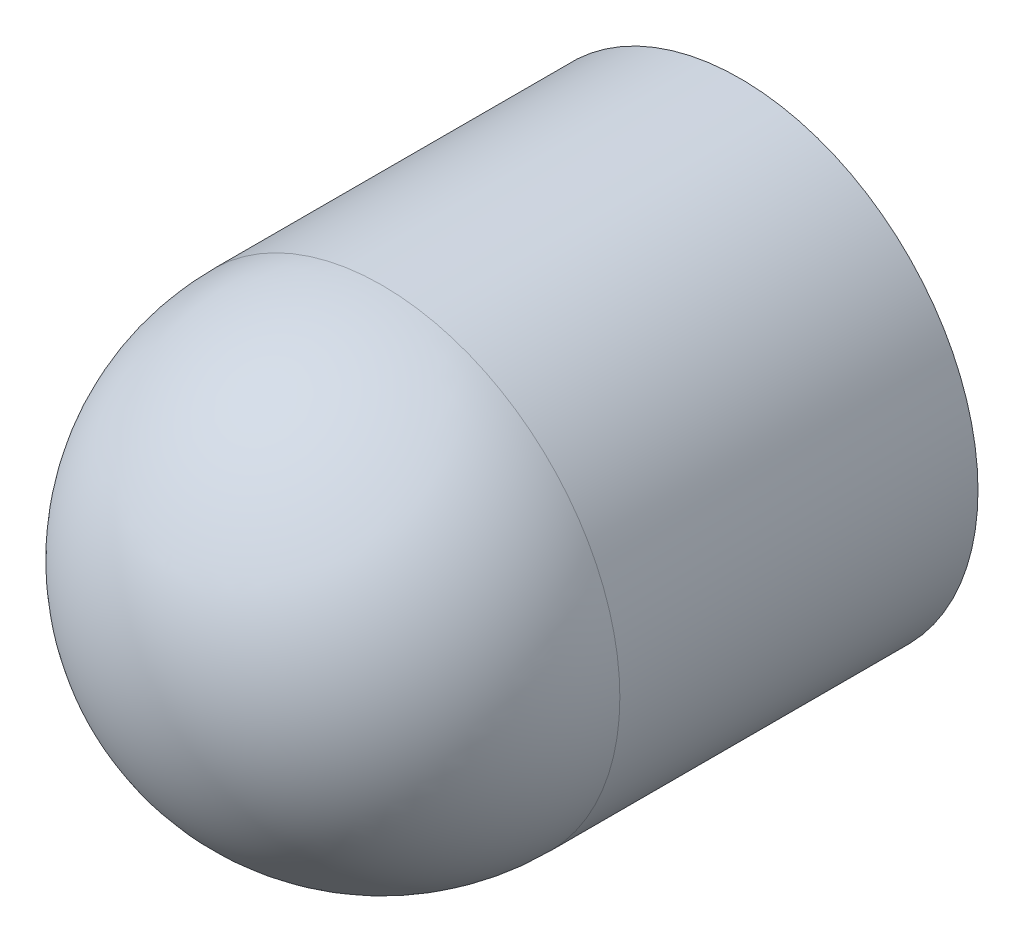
ISO-10303-21;
HEADER;
FILE_DESCRIPTION(('STEP AP214'),'2;1');
FILE_NAME('part.step','',(''),(''),'','','');
FILE_SCHEMA(('AUTOMOTIVE_DESIGN { 1 0 10303 214 1 1 1 1 }'));
ENDSEC;
DATA;
#1=APPLICATION_CONTEXT('core data for automotive mechanical design processes');
#2=APPLICATION_PROTOCOL_DEFINITION('international standard','automotive_design',2000,#1);
#3=PRODUCT_CONTEXT('',#1,'mechanical');
#4=PRODUCT('Part','Part','',(#3));
#5=PRODUCT_RELATED_PRODUCT_CATEGORY('part','',(#4));
#6=PRODUCT_DEFINITION_FORMATION('','',#4);
#7=PRODUCT_DEFINITION_CONTEXT('part definition',#1,'design');
#8=PRODUCT_DEFINITION('design','',#6,#7);
#9=PRODUCT_DEFINITION_SHAPE('','',#8);
#10=(LENGTH_UNIT() NAMED_UNIT(*) SI_UNIT(.MILLI.,.METRE.));
#11=(NAMED_UNIT(*) PLANE_ANGLE_UNIT() SI_UNIT($,.RADIAN.));
#12=(NAMED_UNIT(*) SI_UNIT($,.STERADIAN.) SOLID_ANGLE_UNIT());
#13=UNCERTAINTY_MEASURE_WITH_UNIT(LENGTH_MEASURE(1.E-05),#10,'distance_accuracy_value','');
#14=(GEOMETRIC_REPRESENTATION_CONTEXT(3) GLOBAL_UNCERTAINTY_ASSIGNED_CONTEXT((#13)) GLOBAL_UNIT_ASSIGNED_CONTEXT((#10,
#11,#12)) REPRESENTATION_CONTEXT('',''));
#15=CARTESIAN_POINT('',(0.,0.,0.));
#16=DIRECTION('',(0.,0.,1.));
#17=DIRECTION('',(1.,0.,0.));
#18=AXIS2_PLACEMENT_3D('',#15,#16,#17);
#19=CARTESIAN_POINT('',(0.,0.,-3.1623));
#20=DIRECTION('',(0.,0.,1.));
#21=DIRECTION('',(0.,1.,0.));
#22=AXIS2_PLACEMENT_3D('',#19,#20,#21);
#23=SPHERICAL_SURFACE('',#22,3.1623);
#24=CARTESIAN_POINT('',(0.,0.,-3.1623));
#25=DIRECTION('',(0.,0.,1.));
#26=DIRECTION('',(1.,0.,0.));
#27=AXIS2_PLACEMENT_3D('',#24,#25,#26);
#28=CIRCLE('',#27,3.1623);
#29=CARTESIAN_POINT('',(3.1623,0.,-3.1623));
#30=VERTEX_POINT('',#29);
#31=EDGE_CURVE('E10',#30,#30,#28,.T.);
#32=ORIENTED_EDGE('',*,*,#31,.T.);
#33=EDGE_LOOP('',(#32));
#34=FACE_BOUND('',#33,.T.);
#35=ADVANCED_FACE('F33',(#34),#23,.T.);
#36=CARTESIAN_POINT('',(0.,0.,0.));
#37=DIRECTION('',(0.,0.,1.));
#38=DIRECTION('',(1.,0.,0.));
#39=AXIS2_PLACEMENT_3D('',#36,#37,#38);
#40=CYLINDRICAL_SURFACE('',#39,3.1623);
#41=ORIENTED_EDGE('',*,*,#31,.F.);
#42=EDGE_LOOP('',(#41));
#43=FACE_BOUND('',#42,.T.);
#44=CARTESIAN_POINT('',(0.,0.,-7.9248));
#45=DIRECTION('',(0.,0.,1.));
#46=DIRECTION('',(1.,0.,0.));
#47=AXIS2_PLACEMENT_3D('',#44,#45,#46);
#48=CIRCLE('',#47,3.1623);
#49=CARTESIAN_POINT('',(3.1623,0.,-7.9248));
#50=VERTEX_POINT('',#49);
#51=EDGE_CURVE('E39',#50,#50,#48,.T.);
#52=ORIENTED_EDGE('',*,*,#51,.T.);
#53=EDGE_LOOP('',(#52));
#54=FACE_BOUND('',#53,.T.);
#55=ADVANCED_FACE('F45',(#43,#54),#40,.T.);
#56=CARTESIAN_POINT('',(0.,0.,-7.9248));
#57=DIRECTION('',(0.,0.,1.));
#58=DIRECTION('',(1.,0.,0.));
#59=AXIS2_PLACEMENT_3D('',#56,#57,#58);
#60=PLANE('',#59);
#61=ORIENTED_EDGE('',*,*,#51,.F.);
#62=EDGE_LOOP('',(#61));
#63=FACE_BOUND('',#62,.T.);
#64=ADVANCED_FACE('F47',(#63),#60,.F.);
#65=CLOSED_SHELL('',(#35,#55,#64));
#66=MANIFOLD_SOLID_BREP('B2',#65);
#67=ADVANCED_BREP_SHAPE_REPRESENTATION('',(#18,#66),#14);
#68=SHAPE_DEFINITION_REPRESENTATION(#9,#67);
ENDSEC;
END-ISO-10303-21;
